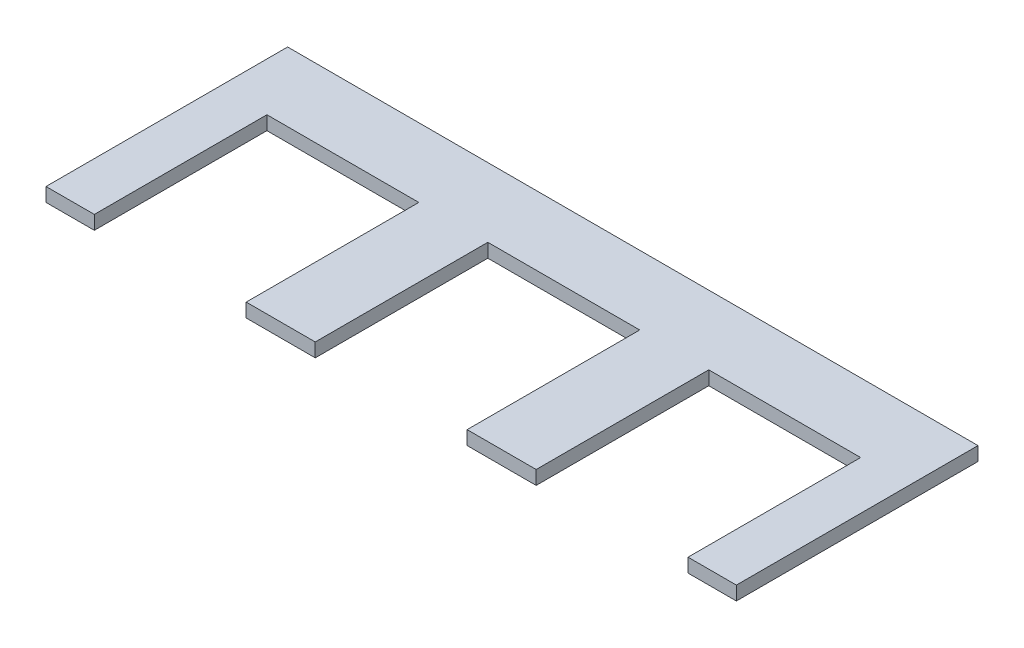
from build123d import *

# Parameters (mm, degrees)
SKETCH2_W           = 1000
SKETCH2_H           = 350
BOSS_EXTRUDE1_DEPTH = 20
SKETCH3_W           = 220
SKETCH3_H           = 250
CUT_EXTRUDE1_DEPTH  = 20


with BuildPart() as part:
    # Sketch2 → Boss-Extrude1 (new body)
    with BuildSketch(Plane(origin=(0, 0, 0), x_dir=(1, 0, 0), z_dir=(0, 1, 0))):
        Rectangle(SKETCH2_W, SKETCH2_H)
    extrude(amount=BOSS_EXTRUDE1_DEPTH)

    # Sketch3 → Cut-Extrude1 (cut)
    with BuildSketch(Plane(origin=(0, 20, 0), x_dir=(1, 0, 0), z_dir=(0, 1, 0))):
        with Locations((0, -50)):
            Rectangle(SKETCH3_W, SKETCH3_H)
        with Locations((320, -50)):
            Rectangle(SKETCH3_W, SKETCH3_H)
        with Locations((-320, -50)):
            Rectangle(SKETCH3_W, SKETCH3_H)
    extrude(amount=-CUT_EXTRUDE1_DEPTH, mode=Mode.SUBTRACT)


solid = part.part
